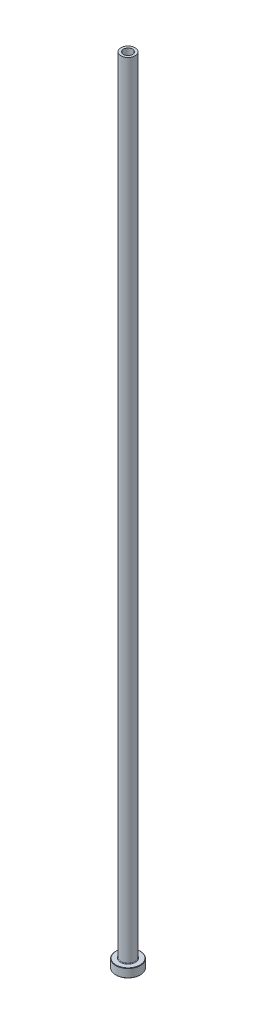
ISO-10303-21;
HEADER;
FILE_DESCRIPTION(('STEP AP214'),'2;1');
FILE_NAME('part.step','',(''),(''),'','','');
FILE_SCHEMA(('AUTOMOTIVE_DESIGN { 1 0 10303 214 1 1 1 1 }'));
ENDSEC;
DATA;
#1=APPLICATION_CONTEXT('core data for automotive mechanical design processes');
#2=APPLICATION_PROTOCOL_DEFINITION('international standard','automotive_design',2000,#1);
#3=PRODUCT_CONTEXT('',#1,'mechanical');
#4=PRODUCT('Part','Part','',(#3));
#5=PRODUCT_RELATED_PRODUCT_CATEGORY('part','',(#4));
#6=PRODUCT_DEFINITION_FORMATION('','',#4);
#7=PRODUCT_DEFINITION_CONTEXT('part definition',#1,'design');
#8=PRODUCT_DEFINITION('design','',#6,#7);
#9=PRODUCT_DEFINITION_SHAPE('','',#8);
#10=(LENGTH_UNIT() NAMED_UNIT(*) SI_UNIT(.MILLI.,.METRE.));
#11=(NAMED_UNIT(*) PLANE_ANGLE_UNIT() SI_UNIT($,.RADIAN.));
#12=(NAMED_UNIT(*) SI_UNIT($,.STERADIAN.) SOLID_ANGLE_UNIT());
#13=UNCERTAINTY_MEASURE_WITH_UNIT(LENGTH_MEASURE(1.E-05),#10,'distance_accuracy_value','');
#14=(GEOMETRIC_REPRESENTATION_CONTEXT(3) GLOBAL_UNCERTAINTY_ASSIGNED_CONTEXT((#13)) GLOBAL_UNIT_ASSIGNED_CONTEXT((#10,
#11,#12)) REPRESENTATION_CONTEXT('',''));
#15=CARTESIAN_POINT('',(0.,0.,0.));
#16=DIRECTION('',(0.,0.,1.));
#17=DIRECTION('',(1.,0.,0.));
#18=AXIS2_PLACEMENT_3D('',#15,#16,#17);
#19=CARTESIAN_POINT('',(0.,92.1876809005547,0.));
#20=DIRECTION('',(0.,1.,0.));
#21=DIRECTION('',(0.,0.,1.));
#22=AXIS2_PLACEMENT_3D('',#19,#20,#21);
#23=CYLINDRICAL_SURFACE('',#22,2.60000000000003);
#24=CARTESIAN_POINT('',(0.,450.,0.));
#25=DIRECTION('',(0.,1.,0.));
#26=DIRECTION('',(0.,0.,1.));
#27=AXIS2_PLACEMENT_3D('',#24,#25,#26);
#28=CIRCLE('',#27,2.60000000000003);
#29=CARTESIAN_POINT('',(0.,450.,2.60000000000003));
#30=VERTEX_POINT('',#29);
#31=EDGE_CURVE('E62',#30,#30,#28,.T.);
#32=ORIENTED_EDGE('',*,*,#31,.T.);
#33=EDGE_LOOP('',(#32));
#34=FACE_BOUND('',#33,.T.);
#35=CARTESIAN_POINT('',(0.,405.,0.));
#36=DIRECTION('',(0.,1.,0.));
#37=DIRECTION('',(0.,0.,1.));
#38=AXIS2_PLACEMENT_3D('',#35,#36,#37);
#39=CIRCLE('',#38,2.60000000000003);
#40=CARTESIAN_POINT('',(0.,405.,2.60000000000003));
#41=VERTEX_POINT('',#40);
#42=EDGE_CURVE('E71',#41,#41,#39,.T.);
#43=ORIENTED_EDGE('',*,*,#42,.F.);
#44=EDGE_LOOP('',(#43));
#45=FACE_BOUND('',#44,.T.);
#46=ADVANCED_FACE('F30',(#34,#45),#23,.F.);
#47=CARTESIAN_POINT('',(-2.60000000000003,450.,0.));
#48=DIRECTION('',(0.,1.,0.));
#49=DIRECTION('',(0.,0.,1.));
#50=AXIS2_PLACEMENT_3D('',#47,#48,#49);
#51=PLANE('',#50);
#52=CARTESIAN_POINT('',(0.,450.,0.));
#53=DIRECTION('',(0.,1.,0.));
#54=DIRECTION('',(0.,0.,1.));
#55=AXIS2_PLACEMENT_3D('',#52,#53,#54);
#56=CIRCLE('',#55,4.00000000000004);
#57=CARTESIAN_POINT('',(0.,450.,4.00000000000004));
#58=VERTEX_POINT('',#57);
#59=EDGE_CURVE('E65',#58,#58,#56,.T.);
#60=ORIENTED_EDGE('',*,*,#59,.T.);
#61=EDGE_LOOP('',(#60));
#62=FACE_BOUND('',#61,.T.);
#63=ORIENTED_EDGE('',*,*,#31,.F.);
#64=EDGE_LOOP('',(#63));
#65=FACE_BOUND('',#64,.T.);
#66=ADVANCED_FACE('F79',(#62,#65),#51,.T.);
#67=CARTESIAN_POINT('',(0.,92.1876809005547,0.));
#68=DIRECTION('',(0.,1.,0.));
#69=DIRECTION('',(0.,0.,1.));
#70=AXIS2_PLACEMENT_3D('',#67,#68,#69);
#71=CYLINDRICAL_SURFACE('',#70,4.00000000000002);
#72=CARTESIAN_POINT('',(0.,5.3,0.));
#73=DIRECTION('',(0.,1.,0.));
#74=DIRECTION('',(0.,0.,1.));
#75=AXIS2_PLACEMENT_3D('',#72,#73,#74);
#76=CIRCLE('',#75,4.00000000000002);
#77=CARTESIAN_POINT('',(0.,5.3,4.00000000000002));
#78=VERTEX_POINT('',#77);
#79=EDGE_CURVE('E59',#78,#78,#76,.T.);
#80=ORIENTED_EDGE('',*,*,#79,.T.);
#81=EDGE_LOOP('',(#80));
#82=FACE_BOUND('',#81,.T.);
#83=ORIENTED_EDGE('',*,*,#59,.F.);
#84=EDGE_LOOP('',(#83));
#85=FACE_BOUND('',#84,.T.);
#86=ADVANCED_FACE('F85',(#82,#85),#71,.T.);
#87=CARTESIAN_POINT('',(-3.99999999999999,5.,0.));
#88=DIRECTION('',(0.,1.,0.));
#89=DIRECTION('',(0.,0.,1.));
#90=AXIS2_PLACEMENT_3D('',#87,#88,#89);
#91=PLANE('',#90);
#92=CARTESIAN_POINT('',(0.,5.,0.));
#93=DIRECTION('',(0.,1.,0.));
#94=DIRECTION('',(0.,0.,1.));
#95=AXIS2_PLACEMENT_3D('',#92,#93,#94);
#96=CIRCLE('',#95,6.80000000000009);
#97=CARTESIAN_POINT('',(0.,5.,-6.80000000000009));
#98=VERTEX_POINT('',#97);
#99=EDGE_CURVE('E53',#98,#98,#96,.T.);
#100=ORIENTED_EDGE('',*,*,#99,.T.);
#101=EDGE_LOOP('',(#100));
#102=FACE_BOUND('',#101,.T.);
#103=CARTESIAN_POINT('',(0.,5.,0.));
#104=DIRECTION('',(0.,1.,0.));
#105=DIRECTION('',(0.,0.,1.));
#106=AXIS2_PLACEMENT_3D('',#103,#104,#105);
#107=CIRCLE('',#106,4.30000000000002);
#108=CARTESIAN_POINT('',(0.,5.,4.30000000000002));
#109=VERTEX_POINT('',#108);
#110=EDGE_CURVE('E56',#109,#109,#107,.F.);
#111=ORIENTED_EDGE('',*,*,#110,.T.);
#112=EDGE_LOOP('',(#111));
#113=FACE_BOUND('',#112,.T.);
#114=ADVANCED_FACE('F111',(#102,#113),#91,.T.);
#115=CARTESIAN_POINT('',(0.,92.1876809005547,0.));
#116=DIRECTION('',(0.,1.,0.));
#117=DIRECTION('',(0.,0.,1.));
#118=AXIS2_PLACEMENT_3D('',#115,#116,#117);
#119=CYLINDRICAL_SURFACE('',#118,6.99999999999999);
#120=CARTESIAN_POINT('',(0.,4.80000000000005,0.));
#121=DIRECTION('',(0.,1.,0.));
#122=DIRECTION('',(0.,0.,1.));
#123=AXIS2_PLACEMENT_3D('',#120,#121,#122);
#124=CIRCLE('',#123,6.99999999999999);
#125=CARTESIAN_POINT('',(0.,4.80000000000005,-6.99999999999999));
#126=VERTEX_POINT('',#125);
#127=EDGE_CURVE('E45',#126,#126,#124,.F.);
#128=ORIENTED_EDGE('',*,*,#127,.T.);
#129=EDGE_LOOP('',(#128));
#130=FACE_BOUND('',#129,.T.);
#131=CARTESIAN_POINT('',(0.,0.199999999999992,0.));
#132=DIRECTION('',(0.,-1.,0.));
#133=DIRECTION('',(0.,0.,-1.));
#134=AXIS2_PLACEMENT_3D('',#131,#132,#133);
#135=CIRCLE('',#134,6.99999999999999);
#136=CARTESIAN_POINT('',(0.,0.199999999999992,-6.99999999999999));
#137=VERTEX_POINT('',#136);
#138=EDGE_CURVE('E50',#137,#137,#135,.F.);
#139=ORIENTED_EDGE('',*,*,#138,.T.);
#140=EDGE_LOOP('',(#139));
#141=FACE_BOUND('',#140,.T.);
#142=ADVANCED_FACE('F108',(#130,#141),#119,.T.);
#143=CARTESIAN_POINT('',(-6.99999999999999,0.,0.));
#144=DIRECTION('',(0.,-1.,0.));
#145=DIRECTION('',(0.,0.,-1.));
#146=AXIS2_PLACEMENT_3D('',#143,#144,#145);
#147=PLANE('',#146);
#148=CARTESIAN_POINT('',(0.,0.,0.));
#149=DIRECTION('',(0.,-1.,0.));
#150=DIRECTION('',(0.,0.,-1.));
#151=AXIS2_PLACEMENT_3D('',#148,#149,#150);
#152=CIRCLE('',#151,3.34999999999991);
#153=CARTESIAN_POINT('',(0.,0.,-3.34999999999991));
#154=VERTEX_POINT('',#153);
#155=EDGE_CURVE('E37',#154,#154,#152,.F.);
#156=ORIENTED_EDGE('',*,*,#155,.T.);
#157=EDGE_LOOP('',(#156));
#158=FACE_BOUND('',#157,.T.);
#159=CARTESIAN_POINT('',(0.,0.,0.));
#160=DIRECTION('',(0.,-1.,0.));
#161=DIRECTION('',(0.,0.,-1.));
#162=AXIS2_PLACEMENT_3D('',#159,#160,#161);
#163=CIRCLE('',#162,6.80000000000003);
#164=CARTESIAN_POINT('',(0.,0.,-6.80000000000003));
#165=VERTEX_POINT('',#164);
#166=EDGE_CURVE('E41',#165,#165,#163,.T.);
#167=ORIENTED_EDGE('',*,*,#166,.T.);
#168=EDGE_LOOP('',(#167));
#169=FACE_BOUND('',#168,.T.);
#170=ADVANCED_FACE('F110',(#158,#169),#147,.T.);
#171=CARTESIAN_POINT('',(0.,92.1876809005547,0.));
#172=DIRECTION('',(0.,1.,0.));
#173=DIRECTION('',(0.,0.,1.));
#174=AXIS2_PLACEMENT_3D('',#171,#172,#173);
#175=CYLINDRICAL_SURFACE('',#174,2.85000000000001);
#176=CARTESIAN_POINT('',(0.,0.499999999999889,0.));
#177=DIRECTION('',(0.,-1.,0.));
#178=DIRECTION('',(0.,0.,-1.));
#179=AXIS2_PLACEMENT_3D('',#176,#177,#178);
#180=CIRCLE('',#179,2.85000000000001);
#181=CARTESIAN_POINT('',(0.,0.499999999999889,-2.85000000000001));
#182=VERTEX_POINT('',#181);
#183=EDGE_CURVE('E10',#182,#182,#180,.T.);
#184=ORIENTED_EDGE('',*,*,#183,.T.);
#185=EDGE_LOOP('',(#184));
#186=FACE_BOUND('',#185,.T.);
#187=CARTESIAN_POINT('',(0.,393.,0.));
#188=DIRECTION('',(0.,1.,0.));
#189=DIRECTION('',(0.,0.,1.));
#190=AXIS2_PLACEMENT_3D('',#187,#188,#189);
#191=CIRCLE('',#190,2.85000000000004);
#192=CARTESIAN_POINT('',(0.,393.,2.85000000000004));
#193=VERTEX_POINT('',#192);
#194=EDGE_CURVE('E68',#193,#193,#191,.T.);
#195=ORIENTED_EDGE('',*,*,#194,.T.);
#196=EDGE_LOOP('',(#195));
#197=FACE_BOUND('',#196,.T.);
#198=ADVANCED_FACE('F118',(#186,#197),#175,.F.);
#199=CARTESIAN_POINT('',(0.,393.,0.));
#200=DIRECTION('',(0.,-1.,0.));
#201=DIRECTION('',(0.,0.,-1.));
#202=AXIS2_PLACEMENT_3D('',#199,#200,#201);
#203=CONICAL_SURFACE('',#202,2.85000000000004,0.0208303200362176);
#204=ORIENTED_EDGE('',*,*,#42,.T.);
#205=EDGE_LOOP('',(#204));
#206=FACE_BOUND('',#205,.T.);
#207=ORIENTED_EDGE('',*,*,#194,.F.);
#208=EDGE_LOOP('',(#207));
#209=FACE_BOUND('',#208,.T.);
#210=ADVANCED_FACE('F75',(#206,#209),#203,.F.);
#211=CARTESIAN_POINT('',(0.,5.3,0.));
#212=DIRECTION('',(0.,1.,0.));
#213=DIRECTION('',(0.,0.,1.));
#214=AXIS2_PLACEMENT_3D('',#211,#212,#213);
#215=TOROIDAL_SURFACE('',#214,4.30000000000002,0.3);
#216=ORIENTED_EDGE('',*,*,#110,.F.);
#217=EDGE_LOOP('',(#216));
#218=FACE_BOUND('',#217,.T.);
#219=ORIENTED_EDGE('',*,*,#79,.F.);
#220=EDGE_LOOP('',(#219));
#221=FACE_BOUND('',#220,.T.);
#222=ADVANCED_FACE('F90',(#218,#221),#215,.F.);
#223=CARTESIAN_POINT('',(0.,5.,0.));
#224=DIRECTION('',(0.,-1.,0.));
#225=DIRECTION('',(0.,0.,-1.));
#226=AXIS2_PLACEMENT_3D('',#223,#224,#225);
#227=CONICAL_SURFACE('',#226,6.80000000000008,0.785398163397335);
#228=CARTESIAN_POINT('',(0.,4.80000000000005,-6.99999999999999));
#229=CARTESIAN_POINT('',(0.,4.80208333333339,-6.99791666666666));
#230=CARTESIAN_POINT('',(0.,4.80416666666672,-6.99583333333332));
#231=CARTESIAN_POINT('',(0.,4.80833333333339,-6.99166666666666));
#232=CARTESIAN_POINT('',(0.,4.81041666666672,-6.98958333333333));
#233=CARTESIAN_POINT('',(0.,4.81458333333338,-6.98541666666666));
#234=CARTESIAN_POINT('',(0.,4.81666666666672,-6.98333333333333));
#235=CARTESIAN_POINT('',(0.,4.82083333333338,-6.97916666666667));
#236=CARTESIAN_POINT('',(0.,4.82291666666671,-6.97708333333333));
#237=CARTESIAN_POINT('',(0.,4.82708333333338,-6.97291666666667));
#238=CARTESIAN_POINT('',(0.,4.82916666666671,-6.97083333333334));
#239=CARTESIAN_POINT('',(0.,4.83333333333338,-6.96666666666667));
#240=CARTESIAN_POINT('',(0.,4.83541666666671,-6.96458333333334));
#241=CARTESIAN_POINT('',(0.,4.83958333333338,-6.96041666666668));
#242=CARTESIAN_POINT('',(0.,4.84166666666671,-6.95833333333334));
#243=CARTESIAN_POINT('',(0.,4.84583333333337,-6.95416666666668));
#244=CARTESIAN_POINT('',(0.,4.84791666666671,-6.95208333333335));
#245=CARTESIAN_POINT('',(0.,4.85208333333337,-6.94791666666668));
#246=CARTESIAN_POINT('',(0.,4.85416666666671,-6.94583333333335));
#247=CARTESIAN_POINT('',(0.,4.85833333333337,-6.94166666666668));
#248=CARTESIAN_POINT('',(0.,4.8604166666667,-6.93958333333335));
#249=CARTESIAN_POINT('',(0.,4.86458333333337,-6.93541666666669));
#250=CARTESIAN_POINT('',(0.,4.8666666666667,-6.93333333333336));
#251=CARTESIAN_POINT('',(0.,4.87083333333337,-6.92916666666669));
#252=CARTESIAN_POINT('',(0.,4.8729166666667,-6.92708333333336));
#253=CARTESIAN_POINT('',(0.,4.87708333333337,-6.92291666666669));
#254=CARTESIAN_POINT('',(0.,4.8791666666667,-6.92083333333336));
#255=CARTESIAN_POINT('',(0.,4.88333333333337,-6.9166666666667));
#256=CARTESIAN_POINT('',(0.,4.8854166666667,-6.91458333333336));
#257=CARTESIAN_POINT('',(0.,4.88958333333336,-6.9104166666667));
#258=CARTESIAN_POINT('',(0.,4.8916666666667,-6.90833333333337));
#259=CARTESIAN_POINT('',(0.,4.89583333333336,-6.9041666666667));
#260=CARTESIAN_POINT('',(0.,4.89791666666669,-6.90208333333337));
#261=CARTESIAN_POINT('',(0.,4.90208333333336,-6.89791666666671));
#262=CARTESIAN_POINT('',(0.,4.90416666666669,-6.89583333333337));
#263=CARTESIAN_POINT('',(0.,4.90833333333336,-6.89166666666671));
#264=CARTESIAN_POINT('',(0.,4.91041666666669,-6.88958333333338));
#265=CARTESIAN_POINT('',(0.,4.91458333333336,-6.88541666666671));
#266=CARTESIAN_POINT('',(0.,4.91666666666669,-6.88333333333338));
#267=CARTESIAN_POINT('',(0.,4.92083333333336,-6.87916666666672));
#268=CARTESIAN_POINT('',(0.,4.92291666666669,-6.87708333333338));
#269=CARTESIAN_POINT('',(0.,4.92708333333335,-6.87291666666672));
#270=CARTESIAN_POINT('',(0.,4.92916666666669,-6.87083333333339));
#271=CARTESIAN_POINT('',(0.,4.93333333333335,-6.86666666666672));
#272=CARTESIAN_POINT('',(0.,4.93541666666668,-6.86458333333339));
#273=CARTESIAN_POINT('',(0.,4.93958333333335,-6.86041666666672));
#274=CARTESIAN_POINT('',(0.,4.94166666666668,-6.85833333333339));
#275=CARTESIAN_POINT('',(0.,4.94583333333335,-6.85416666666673));
#276=CARTESIAN_POINT('',(0.,4.94791666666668,-6.8520833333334));
#277=CARTESIAN_POINT('',(0.,4.95208333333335,-6.84791666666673));
#278=CARTESIAN_POINT('',(0.,4.95416666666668,-6.8458333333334));
#279=CARTESIAN_POINT('',(0.,4.95833333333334,-6.84166666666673));
#280=CARTESIAN_POINT('',(0.,4.96041666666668,-6.8395833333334));
#281=CARTESIAN_POINT('',(0.,4.96458333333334,-6.83541666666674));
#282=CARTESIAN_POINT('',(0.,4.96666666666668,-6.8333333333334));
#283=CARTESIAN_POINT('',(0.,4.97083333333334,-6.82916666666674));
#284=CARTESIAN_POINT('',(0.,4.97291666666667,-6.82708333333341));
#285=CARTESIAN_POINT('',(0.,4.97708333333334,-6.82291666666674));
#286=CARTESIAN_POINT('',(0.,4.97916666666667,-6.82083333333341));
#287=CARTESIAN_POINT('',(0.,4.98333333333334,-6.81666666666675));
#288=CARTESIAN_POINT('',(0.,4.98541666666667,-6.81458333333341));
#289=CARTESIAN_POINT('',(0.,4.98958333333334,-6.81041666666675));
#290=CARTESIAN_POINT('',(0.,4.99166666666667,-6.80833333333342));
#291=CARTESIAN_POINT('',(0.,4.99583333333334,-6.80416666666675));
#292=CARTESIAN_POINT('',(0.,4.99791666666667,-6.80208333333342));
#293=CARTESIAN_POINT('',(0.,5.,-6.80000000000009));
#294=B_SPLINE_CURVE_WITH_KNOTS('',3,(#228,#229,#230,#231,#232,#233,#234,#235,#236,#237,#238,
#239,#240,#241,#242,#243,#244,#245,#246,#247,#248,#249,#250,#251,#252,#253,#254,#255,#256,#257,
#258,#259,#260,#261,#262,#263,#264,#265,#266,#267,#268,#269,#270,#271,#272,#273,#274,#275,#276,
#277,#278,#279,#280,#281,#282,#283,#284,#285,#286,#287,#288,#289,#290,#291,#292,#293),
.UNSPECIFIED.,.F.,.F.,(4,2,2,2,2,2,2,2,2,2,2,2,2,2,2,2,2,2,2,2,2,2,2,2,2,2,2,2,2,2,2,2,4),(0.,
0.00883883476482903,0.0176776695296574,0.0265165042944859,0.0353553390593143,0.0441941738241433,
0.0530330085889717,0.0618718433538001,0.070710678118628,0.079549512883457,0.0883883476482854,
0.0972271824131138,0.106066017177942,0.114904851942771,0.1237436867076,0.132582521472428,
0.141421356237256,0.150260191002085,0.159099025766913,0.167937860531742,0.17677669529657,
0.185615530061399,0.194454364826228,0.203293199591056,0.212132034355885,0.220970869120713,
0.229809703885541,0.23864853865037,0.247487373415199,0.256326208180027,0.265165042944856,
0.274003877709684,0.282842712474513),.UNSPECIFIED.);
#295=EDGE_CURVE('BSEAM93',#126,#98,#294,.T.);
#296=ORIENTED_EDGE('',*,*,#127,.F.);
#297=ORIENTED_EDGE('',*,*,#99,.F.);
#298=ORIENTED_EDGE('',*,*,#295,.T.);
#299=ORIENTED_EDGE('',*,*,#295,.F.);
#300=EDGE_LOOP('',(#296,#298,#297,#299));
#301=FACE_BOUND('',#300,.T.);
#302=ADVANCED_FACE('F93',(#301),#227,.T.);
#303=CARTESIAN_POINT('',(0.,0.199999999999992,0.));
#304=DIRECTION('',(0.,1.,0.));
#305=DIRECTION('',(0.,0.,1.));
#306=AXIS2_PLACEMENT_3D('',#303,#304,#305);
#307=CONICAL_SURFACE('',#306,6.99999999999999,0.78539816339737);
#308=ORIENTED_EDGE('',*,*,#166,.F.);
#309=EDGE_LOOP('',(#308));
#310=FACE_BOUND('',#309,.T.);
#311=ORIENTED_EDGE('',*,*,#138,.F.);
#312=EDGE_LOOP('',(#311));
#313=FACE_BOUND('',#312,.T.);
#314=ADVANCED_FACE('F96',(#310,#313),#307,.T.);
#315=CARTESIAN_POINT('',(0.,0.,0.));
#316=DIRECTION('',(0.,-1.,0.));
#317=DIRECTION('',(0.,0.,-1.));
#318=AXIS2_PLACEMENT_3D('',#315,#316,#317);
#319=CONICAL_SURFACE('',#318,3.34999999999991,0.785398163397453);
#320=ORIENTED_EDGE('',*,*,#183,.F.);
#321=EDGE_LOOP('',(#320));
#322=FACE_BOUND('',#321,.T.);
#323=ORIENTED_EDGE('',*,*,#155,.F.);
#324=EDGE_LOOP('',(#323));
#325=FACE_BOUND('',#324,.T.);
#326=ADVANCED_FACE('F32',(#322,#325),#319,.F.);
#327=CLOSED_SHELL('',(#46,#66,#86,#114,#142,#170,#198,#210,#222,#302,#314,#326));
#328=MANIFOLD_SOLID_BREP('B2',#327);
#329=ADVANCED_BREP_SHAPE_REPRESENTATION('',(#18,#328),#14);
#330=SHAPE_DEFINITION_REPRESENTATION(#9,#329);
ENDSEC;
END-ISO-10303-21;
